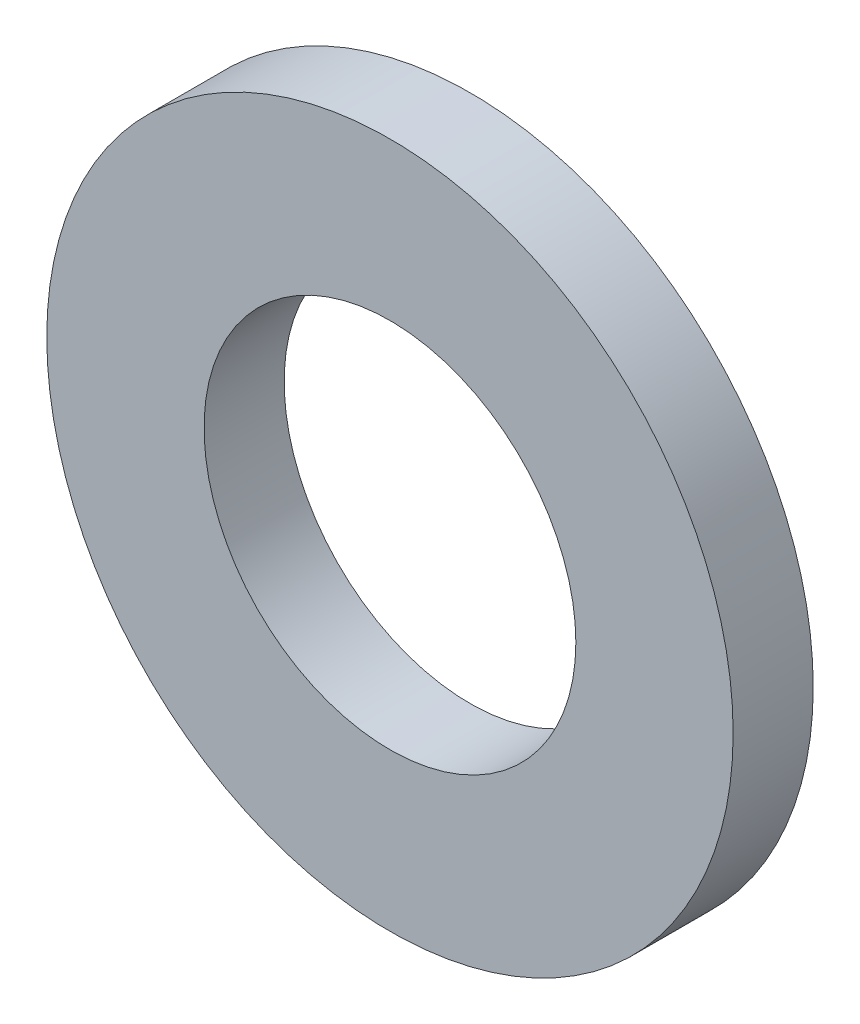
from build123d import *

# Parameters (mm, degrees)
ESQUISSE1_R        = 6
ESQUISSE1_R_2      = 3.25
BOSS_EXTRU_1_DEPTH = 1.4


with BuildPart() as part:
    # Esquisse1 → Boss.-Extru.1 (new body)
    with BuildSketch(Plane.XY):
        Circle(ESQUISSE1_R)
        Circle(ESQUISSE1_R_2, mode=Mode.SUBTRACT)
    extrude(amount=BOSS_EXTRU_1_DEPTH)


solid = part.part
